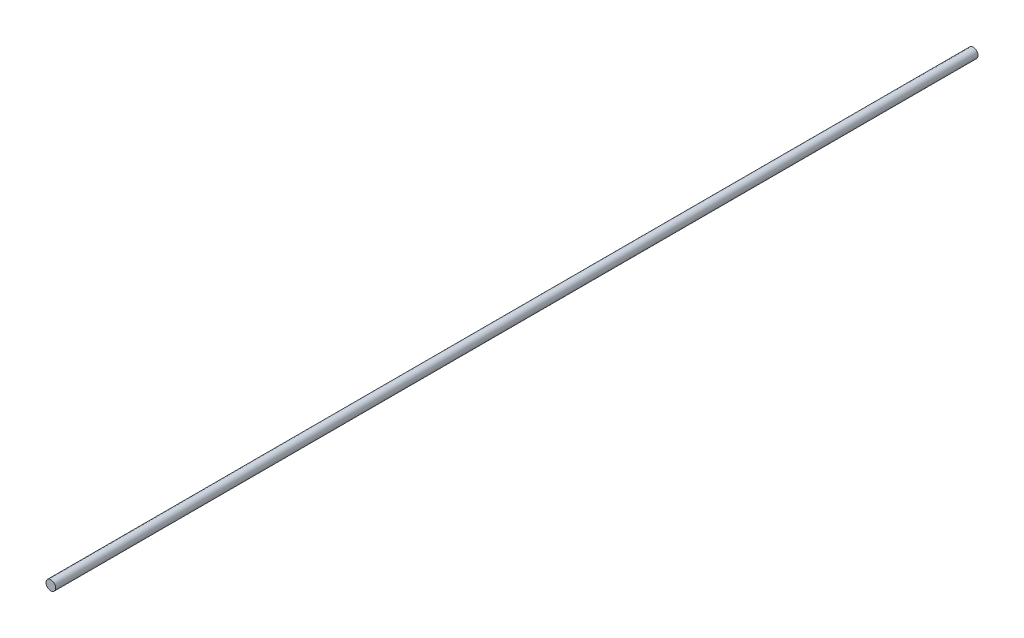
ISO-10303-21;
HEADER;
FILE_DESCRIPTION(('STEP AP214'),'2;1');
FILE_NAME('part.step','',(''),(''),'','','');
FILE_SCHEMA(('AUTOMOTIVE_DESIGN { 1 0 10303 214 1 1 1 1 }'));
ENDSEC;
DATA;
#1=APPLICATION_CONTEXT('core data for automotive mechanical design processes');
#2=APPLICATION_PROTOCOL_DEFINITION('international standard','automotive_design',2000,#1);
#3=PRODUCT_CONTEXT('',#1,'mechanical');
#4=PRODUCT('Part','Part','',(#3));
#5=PRODUCT_RELATED_PRODUCT_CATEGORY('part','',(#4));
#6=PRODUCT_DEFINITION_FORMATION('','',#4);
#7=PRODUCT_DEFINITION_CONTEXT('part definition',#1,'design');
#8=PRODUCT_DEFINITION('design','',#6,#7);
#9=PRODUCT_DEFINITION_SHAPE('','',#8);
#10=(LENGTH_UNIT() NAMED_UNIT(*) SI_UNIT(.MILLI.,.METRE.));
#11=(NAMED_UNIT(*) PLANE_ANGLE_UNIT() SI_UNIT($,.RADIAN.));
#12=(NAMED_UNIT(*) SI_UNIT($,.STERADIAN.) SOLID_ANGLE_UNIT());
#13=UNCERTAINTY_MEASURE_WITH_UNIT(LENGTH_MEASURE(1.E-05),#10,'distance_accuracy_value','');
#14=(GEOMETRIC_REPRESENTATION_CONTEXT(3) GLOBAL_UNCERTAINTY_ASSIGNED_CONTEXT((#13)) GLOBAL_UNIT_ASSIGNED_CONTEXT((#10,
#11,#12)) REPRESENTATION_CONTEXT('',''));
#15=CARTESIAN_POINT('',(0.,0.,0.));
#16=DIRECTION('',(0.,0.,1.));
#17=DIRECTION('',(1.,0.,0.));
#18=AXIS2_PLACEMENT_3D('',#15,#16,#17);
#19=CARTESIAN_POINT('',(0.,0.,-5750.));
#20=DIRECTION('',(0.,0.,1.));
#21=DIRECTION('',(1.,0.,0.));
#22=AXIS2_PLACEMENT_3D('',#19,#20,#21);
#23=CYLINDRICAL_SURFACE('',#22,30.);
#24=CARTESIAN_POINT('',(0.,0.,-5750.));
#25=DIRECTION('',(0.,0.,1.));
#26=DIRECTION('',(1.,0.,0.));
#27=AXIS2_PLACEMENT_3D('',#24,#25,#26);
#28=CIRCLE('',#27,30.);
#29=CARTESIAN_POINT('',(30.,0.,-5750.));
#30=VERTEX_POINT('',#29);
#31=EDGE_CURVE('E10',#30,#30,#28,.T.);
#32=ORIENTED_EDGE('',*,*,#31,.T.);
#33=EDGE_LOOP('',(#32));
#34=FACE_BOUND('',#33,.T.);
#35=CARTESIAN_POINT('',(0.,0.,0.));
#36=DIRECTION('',(0.,0.,1.));
#37=DIRECTION('',(1.,0.,0.));
#38=AXIS2_PLACEMENT_3D('',#35,#36,#37);
#39=CIRCLE('',#38,30.);
#40=CARTESIAN_POINT('',(30.,0.,0.));
#41=VERTEX_POINT('',#40);
#42=EDGE_CURVE('E40',#41,#41,#39,.T.);
#43=ORIENTED_EDGE('',*,*,#42,.F.);
#44=EDGE_LOOP('',(#43));
#45=FACE_BOUND('',#44,.T.);
#46=ADVANCED_FACE('F37',(#34,#45),#23,.T.);
#47=CARTESIAN_POINT('',(0.,0.,-5750.));
#48=DIRECTION('',(0.,0.,1.));
#49=DIRECTION('',(1.,0.,0.));
#50=AXIS2_PLACEMENT_3D('',#47,#48,#49);
#51=PLANE('',#50);
#52=ORIENTED_EDGE('',*,*,#31,.F.);
#53=EDGE_LOOP('',(#52));
#54=FACE_BOUND('',#53,.T.);
#55=ADVANCED_FACE('F54',(#54),#51,.F.);
#56=CARTESIAN_POINT('',(0.,0.,0.));
#57=DIRECTION('',(0.,0.,1.));
#58=DIRECTION('',(1.,0.,0.));
#59=AXIS2_PLACEMENT_3D('',#56,#57,#58);
#60=PLANE('',#59);
#61=ORIENTED_EDGE('',*,*,#42,.T.);
#62=EDGE_LOOP('',(#61));
#63=FACE_BOUND('',#62,.T.);
#64=ADVANCED_FACE('F51',(#63),#60,.T.);
#65=CLOSED_SHELL('',(#46,#55,#64));
#66=MANIFOLD_SOLID_BREP('B2',#65);
#67=ADVANCED_BREP_SHAPE_REPRESENTATION('',(#18,#66),#14);
#68=SHAPE_DEFINITION_REPRESENTATION(#9,#67);
ENDSEC;
END-ISO-10303-21;
